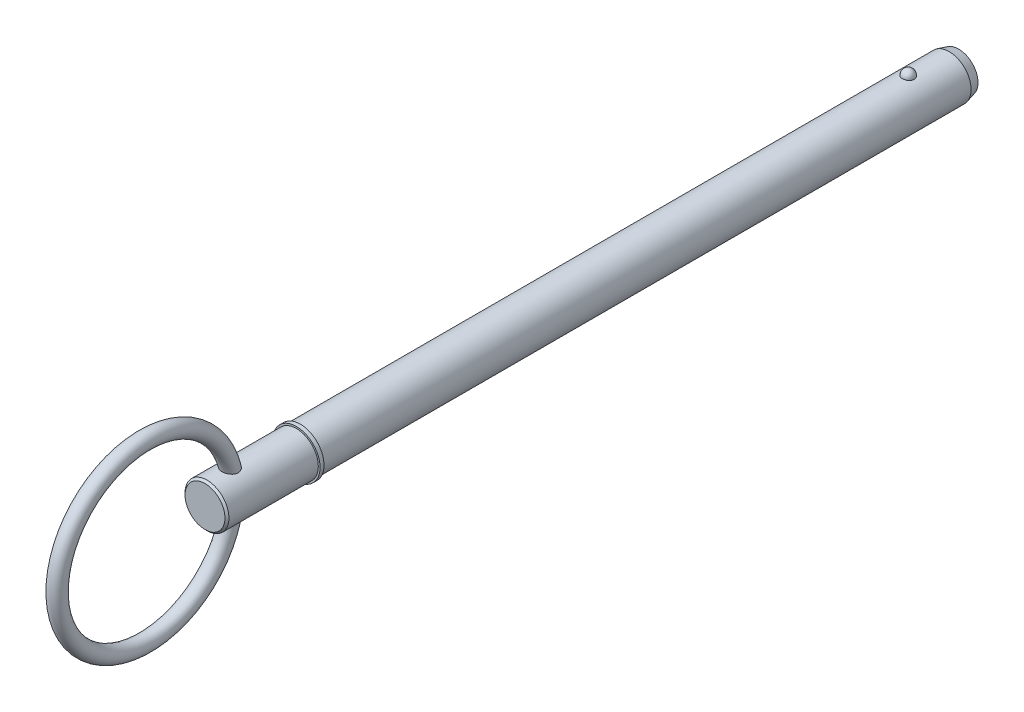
ISO-10303-21;
HEADER;
FILE_DESCRIPTION(('STEP AP214'),'2;1');
FILE_NAME('part.step','',(''),(''),'','','');
FILE_SCHEMA(('AUTOMOTIVE_DESIGN { 1 0 10303 214 1 1 1 1 }'));
ENDSEC;
DATA;
#1=APPLICATION_CONTEXT('core data for automotive mechanical design processes');
#2=APPLICATION_PROTOCOL_DEFINITION('international standard','automotive_design',2000,#1);
#3=PRODUCT_CONTEXT('',#1,'mechanical');
#4=PRODUCT('Part','Part','',(#3));
#5=PRODUCT_RELATED_PRODUCT_CATEGORY('part','',(#4));
#6=PRODUCT_DEFINITION_FORMATION('','',#4);
#7=PRODUCT_DEFINITION_CONTEXT('part definition',#1,'design');
#8=PRODUCT_DEFINITION('design','',#6,#7);
#9=PRODUCT_DEFINITION_SHAPE('','',#8);
#10=(LENGTH_UNIT() NAMED_UNIT(*) SI_UNIT(.MILLI.,.METRE.));
#11=(NAMED_UNIT(*) PLANE_ANGLE_UNIT() SI_UNIT($,.RADIAN.));
#12=(NAMED_UNIT(*) SI_UNIT($,.STERADIAN.) SOLID_ANGLE_UNIT());
#13=UNCERTAINTY_MEASURE_WITH_UNIT(LENGTH_MEASURE(1.E-05),#10,'distance_accuracy_value','');
#14=(GEOMETRIC_REPRESENTATION_CONTEXT(3) GLOBAL_UNCERTAINTY_ASSIGNED_CONTEXT((#13)) GLOBAL_UNIT_ASSIGNED_CONTEXT((#10,
#11,#12)) REPRESENTATION_CONTEXT('',''));
#15=CARTESIAN_POINT('',(0.,0.,0.));
#16=DIRECTION('',(0.,0.,1.));
#17=DIRECTION('',(1.,0.,0.));
#18=AXIS2_PLACEMENT_3D('',#15,#16,#17);
#19=CARTESIAN_POINT('',(0.,0.,152.4));
#20=DIRECTION('',(0.,0.,-1.));
#21=DIRECTION('',(-1.,0.,0.));
#22=AXIS2_PLACEMENT_3D('',#19,#20,#21);
#23=CYLINDRICAL_SURFACE('',#22,5.555);
#24=CARTESIAN_POINT('',(1.47653932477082,5.35517101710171,-1.49));
#25=CARTESIAN_POINT('',(1.4765376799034,5.35517235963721,-1.40667872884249));
#26=CARTESIAN_POINT('',(1.4697233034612,5.35706459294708,-1.32333626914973));
#27=CARTESIAN_POINT('',(1.4426291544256,5.36442332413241,-1.15900769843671));
#28=CARTESIAN_POINT('',(1.42234344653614,5.36989139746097,-1.07802264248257));
#29=CARTESIAN_POINT('',(1.36882802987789,5.38378061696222,-0.920757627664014));
#30=CARTESIAN_POINT('',(1.33560404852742,5.39220045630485,-0.844475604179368));
#31=CARTESIAN_POINT('',(1.25704906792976,5.41105136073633,-0.69870312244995));
#32=CARTESIAN_POINT('',(1.21171855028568,5.42148234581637,-0.62921239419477));
#33=CARTESIAN_POINT('',(1.10986325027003,5.44324765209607,-0.498626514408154));
#34=CARTESIAN_POINT('',(1.05328868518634,5.45458585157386,-0.437570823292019));
#35=CARTESIAN_POINT('',(0.930545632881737,5.4768596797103,-0.325918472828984));
#36=CARTESIAN_POINT('',(0.864377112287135,5.48779530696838,-0.275321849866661));
#37=CARTESIAN_POINT('',(0.724412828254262,5.50801510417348,-0.186125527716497));
#38=CARTESIAN_POINT('',(0.650637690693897,5.51730356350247,-0.147494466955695));
#39=CARTESIAN_POINT('',(0.497383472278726,5.53322345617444,-0.0831582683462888));
#40=CARTESIAN_POINT('',(0.417904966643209,5.53985515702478,-0.0574518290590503));
#41=CARTESIAN_POINT('',(0.256903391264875,5.54963245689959,-0.0200294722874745));
#42=CARTESIAN_POINT('',(0.175435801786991,5.55283384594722,-0.00808940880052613));
#43=CARTESIAN_POINT('',(0.0115885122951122,5.55559187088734,0.00221439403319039));
#44=CARTESIAN_POINT('',(-0.070791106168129,5.55514883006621,0.000579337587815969));
#45=CARTESIAN_POINT('',(-0.23298012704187,5.55069756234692,-0.0161051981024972));
#46=CARTESIAN_POINT('',(-0.312809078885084,5.54673626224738,-0.0309781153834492));
#47=CARTESIAN_POINT('',(-0.468771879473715,5.5357377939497,-0.073474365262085));
#48=CARTESIAN_POINT('',(-0.544905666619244,5.52870057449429,-0.101097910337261));
#49=CARTESIAN_POINT('',(-0.691800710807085,5.51225307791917,-0.168516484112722));
#50=CARTESIAN_POINT('',(-0.762530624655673,5.50283015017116,-0.208376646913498));
#51=CARTESIAN_POINT('',(-0.896294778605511,5.48263289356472,-0.29913698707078));
#52=CARTESIAN_POINT('',(-0.959328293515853,5.47185843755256,-0.350038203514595));
#53=CARTESIAN_POINT('',(-1.0771278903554,5.44990641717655,-0.462517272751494));
#54=CARTESIAN_POINT('',(-1.13172901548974,5.43872509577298,-0.524267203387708));
#55=CARTESIAN_POINT('',(-1.2299173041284,5.41736658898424,-0.656133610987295));
#56=CARTESIAN_POINT('',(-1.2735037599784,5.40718946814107,-0.726250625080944));
#57=CARTESIAN_POINT('',(-1.34896420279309,5.38886361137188,-0.873713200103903));
#58=CARTESIAN_POINT('',(-1.38071142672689,5.38073711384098,-0.951126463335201));
#59=CARTESIAN_POINT('',(-1.4310375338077,5.36757288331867,-1.11037033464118));
#60=CARTESIAN_POINT('',(-1.44961676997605,5.3625350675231,-1.19220082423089));
#61=CARTESIAN_POINT('',(-1.47308754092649,5.35613553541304,-1.35761209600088));
#62=CARTESIAN_POINT('',(-1.47803294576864,5.35475935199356,-1.44118467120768));
#63=CARTESIAN_POINT('',(-1.47426441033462,5.35579807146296,-1.6079958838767));
#64=CARTESIAN_POINT('',(-1.46555080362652,5.35821288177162,-1.69123452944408));
#65=CARTESIAN_POINT('',(-1.43475662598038,5.36653964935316,-1.8546288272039));
#66=CARTESIAN_POINT('',(-1.41273621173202,5.37243586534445,-1.93479663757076));
#67=CARTESIAN_POINT('',(-1.35593151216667,5.38705199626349,-2.09020110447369));
#68=CARTESIAN_POINT('',(-1.32114675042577,5.39577201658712,-2.16543757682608));
#69=CARTESIAN_POINT('',(-1.23947506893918,5.41511674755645,-2.30926926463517));
#70=CARTESIAN_POINT('',(-1.1925277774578,5.42575087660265,-2.37782893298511));
#71=CARTESIAN_POINT('',(-1.08780725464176,5.44771095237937,-2.50598876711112));
#72=CARTESIAN_POINT('',(-1.03003365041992,5.45903692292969,-2.56558862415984));
#73=CARTESIAN_POINT('',(-0.904953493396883,5.48116073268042,-2.67436535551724));
#74=CARTESIAN_POINT('',(-0.837616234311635,5.49195671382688,-2.7235073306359));
#75=CARTESIAN_POINT('',(-0.695379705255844,5.51177099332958,-2.80973172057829));
#76=CARTESIAN_POINT('',(-0.620480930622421,5.52078940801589,-2.84681492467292));
#77=CARTESIAN_POINT('',(-0.466144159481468,5.53594369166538,-2.90749751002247));
#78=CARTESIAN_POINT('',(-0.386768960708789,5.54211181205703,-2.93124844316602));
#79=CARTESIAN_POINT('',(-0.224991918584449,5.5510324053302,-2.96523308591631));
#80=CARTESIAN_POINT('',(-0.142590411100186,5.55378525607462,-2.97546829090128));
#81=CARTESIAN_POINT('',(0.0213711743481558,5.55555351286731,-2.98206550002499));
#82=CARTESIAN_POINT('',(0.102921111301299,5.55463281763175,-2.97866468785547));
#83=CARTESIAN_POINT('',(0.264256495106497,5.54929804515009,-2.95862186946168));
#84=CARTESIAN_POINT('',(0.344041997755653,5.54488407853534,-2.94198028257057));
#85=CARTESIAN_POINT('',(0.499344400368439,5.53305794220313,-2.89600357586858));
#86=CARTESIAN_POINT('',(0.574874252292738,5.52565550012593,-2.86670961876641));
#87=CARTESIAN_POINT('',(0.719898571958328,5.50863937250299,-2.79624249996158));
#88=CARTESIAN_POINT('',(0.789392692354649,5.49902555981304,-2.75506865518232));
#89=CARTESIAN_POINT('',(0.921480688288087,5.47845199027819,-2.66127110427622));
#90=CARTESIAN_POINT('',(0.983960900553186,5.46747485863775,-2.60849118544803));
#91=CARTESIAN_POINT('',(1.09925057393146,5.44546837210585,-2.49325304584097));
#92=CARTESIAN_POINT('',(1.15205830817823,5.43443900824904,-2.43079310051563));
#93=CARTESIAN_POINT('',(1.24742943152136,5.41335152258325,-2.29680711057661));
#94=CARTESIAN_POINT('',(1.28981661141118,5.40331162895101,-2.22515272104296));
#95=CARTESIAN_POINT('',(1.36214937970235,5.38553336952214,-2.07558035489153));
#96=CARTESIAN_POINT('',(1.39210034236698,5.37779400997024,-1.99766510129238));
#97=CARTESIAN_POINT('',(1.43569518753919,5.36630594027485,-1.84848338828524));
#98=CARTESIAN_POINT('',(1.45098536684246,5.36216169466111,-1.77772322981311));
#99=CARTESIAN_POINT('',(1.47140805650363,5.35659367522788,-1.63464735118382));
#100=CARTESIAN_POINT('',(1.47654075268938,5.35516985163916,-1.56233165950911));
#101=CARTESIAN_POINT('',(1.47653932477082,5.35517101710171,-1.49));
#102=B_SPLINE_CURVE_WITH_KNOTS('',3,(#24,#25,#26,#27,#28,#29,#30,#31,#32,#33,#34,#35,#36,#37,
#38,#39,#40,#41,#42,#43,#44,#45,#46,#47,#48,#49,#50,#51,#52,#53,#54,#55,#56,#57,#58,#59,#60,#61,
#62,#63,#64,#65,#66,#67,#68,#69,#70,#71,#72,#73,#74,#75,#76,#77,#78,#79,#80,#81,#82,#83,#84,#85,
#86,#87,#88,#89,#90,#91,#92,#93,#94,#95,#96,#97,#98,#99,#100,#101),.UNSPECIFIED.,.T.,.F.,(4,2,2,
2,2,2,2,2,2,2,2,2,2,2,2,2,2,2,2,2,2,2,2,2,2,2,2,2,2,2,2,2,2,2,2,2,2,2,4),(0.,0.249703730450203,
0.4995175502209,0.749220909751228,0.998914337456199,1.24973894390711,1.50056442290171,
1.75072681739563,2.00086401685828,2.24686822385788,2.49285060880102,2.73560052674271,
2.97835449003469,3.22242369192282,3.46651587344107,3.71490232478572,3.96330473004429,
4.21429522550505,4.46527899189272,4.71526963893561,4.96525418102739,5.21411697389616,
5.46298905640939,5.71312097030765,5.96326150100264,6.21422412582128,6.46517032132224,
6.71320296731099,6.96120816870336,7.20491846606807,7.44862104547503,7.69153667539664,
7.93446627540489,8.18089104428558,8.42735976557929,8.67774679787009,8.92802551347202,
9.14479867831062,9.36156787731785),.UNSPECIFIED.);
#103=CARTESIAN_POINT('',(1.47653932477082,5.35517101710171,-1.49));
#104=VERTEX_POINT('',#103);
#105=EDGE_CURVE('E103',#104,#104,#102,.T.);
#106=ORIENTED_EDGE('',*,*,#105,.T.);
#107=EDGE_LOOP('',(#106));
#108=FACE_BOUND('',#107,.T.);
#109=CARTESIAN_POINT('',(0.,0.,-11.8700000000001));
#110=DIRECTION('',(0.,0.,-1.));
#111=DIRECTION('',(-1.,0.,0.));
#112=AXIS2_PLACEMENT_3D('',#109,#110,#111);
#113=CIRCLE('',#112,5.555);
#114=CARTESIAN_POINT('',(-5.555,0.,-11.8700000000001));
#115=VERTEX_POINT('',#114);
#116=EDGE_CURVE('E110',#115,#115,#113,.F.);
#117=ORIENTED_EDGE('',*,*,#116,.T.);
#118=EDGE_LOOP('',(#117));
#119=FACE_BOUND('',#118,.T.);
#120=CARTESIAN_POINT('',(0.,0.,152.4));
#121=DIRECTION('',(0.,0.,1.));
#122=DIRECTION('',(1.,0.,0.));
#123=AXIS2_PLACEMENT_3D('',#120,#121,#122);
#124=CIRCLE('',#123,5.555);
#125=CARTESIAN_POINT('',(5.555,0.,152.4));
#126=VERTEX_POINT('',#125);
#127=EDGE_CURVE('E108',#126,#126,#124,.T.);
#128=ORIENTED_EDGE('',*,*,#127,.F.);
#129=EDGE_LOOP('',(#128));
#130=FACE_BOUND('',#129,.T.);
#131=ADVANCED_FACE('F39',(#108,#119,#130),#23,.T.);
#132=CARTESIAN_POINT('',(0.,0.,-14.27));
#133=DIRECTION('',(0.,0.,-1.));
#134=DIRECTION('',(-1.,0.,0.));
#135=AXIS2_PLACEMENT_3D('',#132,#133,#134);
#136=PLANE('',#135);
#137=CARTESIAN_POINT('',(0.,0.,-14.27));
#138=DIRECTION('',(0.,0.,-1.));
#139=DIRECTION('',(-1.,0.,0.));
#140=AXIS2_PLACEMENT_3D('',#137,#138,#139);
#141=CIRCLE('',#140,4.91192193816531);
#142=CARTESIAN_POINT('',(-4.91192193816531,0.,-14.27));
#143=VERTEX_POINT('',#142);
#144=EDGE_CURVE('E141',#143,#143,#141,.T.);
#145=ORIENTED_EDGE('',*,*,#144,.T.);
#146=EDGE_LOOP('',(#145));
#147=FACE_BOUND('',#146,.T.);
#148=ADVANCED_FACE('F89',(#147),#136,.T.);
#149=CARTESIAN_POINT('',(0.,0.,-14.27));
#150=DIRECTION('',(0.,0.,1.));
#151=DIRECTION('',(1.,0.,0.));
#152=AXIS2_PLACEMENT_3D('',#149,#150,#151);
#153=CONICAL_SURFACE('',#152,4.91192193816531,0.261799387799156);
#154=ORIENTED_EDGE('',*,*,#116,.F.);
#155=EDGE_LOOP('',(#154));
#156=FACE_BOUND('',#155,.T.);
#157=ORIENTED_EDGE('',*,*,#144,.F.);
#158=EDGE_LOOP('',(#157));
#159=FACE_BOUND('',#158,.T.);
#160=ADVANCED_FACE('F95',(#156,#159),#153,.T.);
#161=CARTESIAN_POINT('',(0.,5.555,-1.49));
#162=DIRECTION('',(0.,1.,0.));
#163=DIRECTION('',(0.,0.,1.));
#164=AXIS2_PLACEMENT_3D('',#161,#162,#163);
#165=SPHERICAL_SURFACE('',#164,1.49);
#166=ORIENTED_EDGE('',*,*,#105,.F.);
#167=EDGE_LOOP('',(#166));
#168=FACE_BOUND('',#167,.T.);
#169=ADVANCED_FACE('F113',(#168),#165,.T.);
#170=CARTESIAN_POINT('',(0.,0.,152.4));
#171=DIRECTION('',(0.,0.,-1.));
#172=DIRECTION('',(-1.,0.,0.));
#173=AXIS2_PLACEMENT_3D('',#170,#171,#172);
#174=PLANE('',#173);
#175=ORIENTED_EDGE('',*,*,#127,.T.);
#176=EDGE_LOOP('',(#175));
#177=FACE_BOUND('',#176,.T.);
#178=CARTESIAN_POINT('',(0.,0.,152.4));
#179=DIRECTION('',(0.,0.,-1.));
#180=DIRECTION('',(-1.,0.,0.));
#181=AXIS2_PLACEMENT_3D('',#178,#179,#180);
#182=CIRCLE('',#181,6.);
#183=CARTESIAN_POINT('',(-6.,0.,152.4));
#184=VERTEX_POINT('',#183);
#185=EDGE_CURVE('E109',#184,#184,#182,.T.);
#186=ORIENTED_EDGE('',*,*,#185,.T.);
#187=EDGE_LOOP('',(#186));
#188=FACE_BOUND('',#187,.T.);
#189=ADVANCED_FACE('F117',(#177,#188),#174,.T.);
#190=CARTESIAN_POINT('',(0.,0.,33.7287874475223));
#191=DIRECTION('',(0.,0.,-1.));
#192=DIRECTION('',(-1.,0.,0.));
#193=AXIS2_PLACEMENT_3D('',#190,#191,#192);
#194=CYLINDRICAL_SURFACE('',#193,6.);
#195=CARTESIAN_POINT('',(0.,0.,153.4));
#196=DIRECTION('',(0.,0.,-1.));
#197=DIRECTION('',(-1.,0.,0.));
#198=AXIS2_PLACEMENT_3D('',#195,#196,#197);
#199=CIRCLE('',#198,6.);
#200=CARTESIAN_POINT('',(-6.,0.,153.4));
#201=VERTEX_POINT('',#200);
#202=EDGE_CURVE('E134',#201,#201,#199,.T.);
#203=ORIENTED_EDGE('',*,*,#202,.T.);
#204=EDGE_LOOP('',(#203));
#205=FACE_BOUND('',#204,.T.);
#206=ORIENTED_EDGE('',*,*,#185,.F.);
#207=EDGE_LOOP('',(#206));
#208=FACE_BOUND('',#207,.T.);
#209=ADVANCED_FACE('F121',(#205,#208),#194,.T.);
#210=CARTESIAN_POINT('',(0.,6.,153.4));
#211=DIRECTION('',(0.,0.,1.));
#212=DIRECTION('',(1.,0.,0.));
#213=AXIS2_PLACEMENT_3D('',#210,#211,#212);
#214=PLANE('',#213);
#215=CARTESIAN_POINT('',(0.,0.,153.4));
#216=DIRECTION('',(0.,0.,1.));
#217=DIRECTION('',(1.,0.,0.));
#218=AXIS2_PLACEMENT_3D('',#215,#216,#217);
#219=CIRCLE('',#218,5.555);
#220=CARTESIAN_POINT('',(5.555,0.,153.4));
#221=VERTEX_POINT('',#220);
#222=EDGE_CURVE('E112',#221,#221,#219,.T.);
#223=ORIENTED_EDGE('',*,*,#222,.F.);
#224=EDGE_LOOP('',(#223));
#225=FACE_BOUND('',#224,.T.);
#226=ORIENTED_EDGE('',*,*,#202,.F.);
#227=EDGE_LOOP('',(#226));
#228=FACE_BOUND('',#227,.T.);
#229=ADVANCED_FACE('F86',(#225,#228),#214,.T.);
#230=CARTESIAN_POINT('',(0.,0.,176.53));
#231=DIRECTION('',(0.,0.,-1.));
#232=DIRECTION('',(-1.,0.,0.));
#233=AXIS2_PLACEMENT_3D('',#230,#231,#232);
#234=CYLINDRICAL_SURFACE('',#233,5.555);
#235=CARTESIAN_POINT('',(-0.961380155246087,-5.47117658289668,168.408733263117));
#236=CARTESIAN_POINT('',(-0.863231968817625,-5.4884217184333,168.357515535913));
#237=CARTESIAN_POINT('',(-0.760548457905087,-5.50372118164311,168.314318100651));
#238=CARTESIAN_POINT('',(-0.548956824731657,-5.52883500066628,168.244912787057));
#239=CARTESIAN_POINT('',(-0.440048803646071,-5.53864944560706,168.218704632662));
#240=CARTESIAN_POINT('',(-0.219033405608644,-5.55178384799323,168.183864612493));
#241=CARTESIAN_POINT('',(-0.106925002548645,-5.55510169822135,168.175238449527));
#242=CARTESIAN_POINT('',(0.11723899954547,-5.55489351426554,168.175783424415));
#243=CARTESIAN_POINT('',(0.229294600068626,-5.55136768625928,168.184954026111));
#244=CARTESIAN_POINT('',(0.449588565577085,-5.5378711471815,168.220784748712));
#245=CARTESIAN_POINT('',(0.557843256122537,-5.52793284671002,168.247356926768));
#246=CARTESIAN_POINT('',(0.768116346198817,-5.50265785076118,168.317309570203));
#247=CARTESIAN_POINT('',(0.870134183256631,-5.48732066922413,168.360691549));
#248=CARTESIAN_POINT('',(1.06580880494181,-5.45270790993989,168.463685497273));
#249=CARTESIAN_POINT('',(1.1594033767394,-5.43340601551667,168.523406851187));
#250=CARTESIAN_POINT('',(1.33484934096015,-5.39298781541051,168.657672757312));
#251=CARTESIAN_POINT('',(1.41670019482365,-5.37187142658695,168.732217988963));
#252=CARTESIAN_POINT('',(1.56628651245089,-5.33017932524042,168.894433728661));
#253=CARTESIAN_POINT('',(1.63402728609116,-5.30960341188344,168.982099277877));
#254=CARTESIAN_POINT('',(1.75338323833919,-5.27139606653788,169.16835593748));
#255=CARTESIAN_POINT('',(1.80500413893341,-5.25376359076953,169.266943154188));
#256=CARTESIAN_POINT('',(1.88923054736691,-5.22405733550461,169.468866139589));
#257=CARTESIAN_POINT('',(1.92240068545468,-5.21182119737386,169.571942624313));
#258=CARTESIAN_POINT('',(1.97156802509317,-5.19342304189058,169.782612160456));
#259=CARTESIAN_POINT('',(1.98756752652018,-5.18726021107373,169.890204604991));
#260=CARTESIAN_POINT('',(2.00238957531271,-5.1815556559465,170.104813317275));
#261=CARTESIAN_POINT('',(2.0015062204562,-5.18190056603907,170.211807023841));
#262=CARTESIAN_POINT('',(1.98404322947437,-5.18861029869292,170.424294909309));
#263=CARTESIAN_POINT('',(1.96745884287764,-5.19497694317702,170.52978862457));
#264=CARTESIAN_POINT('',(1.91810947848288,-5.21340722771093,170.743734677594));
#265=CARTESIAN_POINT('',(1.88435438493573,-5.22581720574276,170.851927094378));
#266=CARTESIAN_POINT('',(1.80161540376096,-5.25491400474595,171.061718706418));
#267=CARTESIAN_POINT('',(1.7526231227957,-5.27160318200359,171.163314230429));
#268=CARTESIAN_POINT('',(1.63431251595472,-5.30955034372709,171.368856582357));
#269=CARTESIAN_POINT('',(1.5633341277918,-5.33111051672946,171.47179646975));
#270=CARTESIAN_POINT('',(1.4052960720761,-5.37493145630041,171.66447165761));
#271=CARTESIAN_POINT('',(1.31822569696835,-5.39719268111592,171.754198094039));
#272=CARTESIAN_POINT('',(1.12728892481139,-5.44031451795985,171.919004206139));
#273=CARTESIAN_POINT('',(1.02309899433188,-5.46113424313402,171.993723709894));
#274=CARTESIAN_POINT('',(0.801576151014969,-5.49800171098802,172.121805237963));
#275=CARTESIAN_POINT('',(0.684264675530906,-5.51405708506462,172.175201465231));
#276=CARTESIAN_POINT('',(0.45687763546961,-5.53719478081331,172.250980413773));
#277=CARTESIAN_POINT('',(0.34797457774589,-5.54519800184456,172.276584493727));
#278=CARTESIAN_POINT('',(0.127042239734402,-5.55464249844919,172.306731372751));
#279=CARTESIAN_POINT('',(0.0150164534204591,-5.55609083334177,172.311296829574));
#280=CARTESIAN_POINT('',(-0.19199318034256,-5.55250986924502,172.299911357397));
#281=CARTESIAN_POINT('',(-0.287160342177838,-5.54836194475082,172.286752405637));
#282=CARTESIAN_POINT('',(-0.473863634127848,-5.53554271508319,172.245489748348));
#283=CARTESIAN_POINT('',(-0.565399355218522,-5.52687090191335,172.217384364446));
#284=CARTESIAN_POINT('',(-0.743786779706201,-5.50572322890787,172.147293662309));
#285=CARTESIAN_POINT('',(-0.830566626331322,-5.49320168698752,172.105141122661));
#286=CARTESIAN_POINT('',(-0.996720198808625,-5.46549909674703,172.008875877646));
#287=CARTESIAN_POINT('',(-1.07609119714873,-5.45031707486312,171.954758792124));
#288=CARTESIAN_POINT('',(-1.23672272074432,-5.41628785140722,171.828211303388));
#289=CARTESIAN_POINT('',(-1.3167603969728,-5.39722327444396,171.75428911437));
#290=CARTESIAN_POINT('',(-1.46504263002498,-5.3588760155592,171.595462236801));
#291=CARTESIAN_POINT('',(-1.5332782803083,-5.33959318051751,171.510549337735));
#292=CARTESIAN_POINT('',(-1.66602271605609,-5.29979878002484,171.318697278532));
#293=CARTESIAN_POINT('',(-1.72857256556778,-5.27951148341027,171.210347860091));
#294=CARTESIAN_POINT('',(-1.83559571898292,-5.24326402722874,170.984325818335));
#295=CARTESIAN_POINT('',(-1.88006296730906,-5.22730531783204,170.866650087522));
#296=CARTESIAN_POINT('',(-1.94988009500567,-5.20167534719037,170.622087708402));
#297=CARTESIAN_POINT('',(-1.97477410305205,-5.19215470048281,170.49505279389));
#298=CARTESIAN_POINT('',(-2.00168294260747,-5.18184594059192,170.238249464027));
#299=CARTESIAN_POINT('',(-2.00372217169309,-5.18104851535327,170.10848411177));
#300=CARTESIAN_POINT('',(-1.98467753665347,-5.18836681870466,169.864652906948));
#301=CARTESIAN_POINT('',(-1.96600067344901,-5.19555485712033,169.750370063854));
#302=CARTESIAN_POINT('',(-1.90923541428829,-5.21668050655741,169.527389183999));
#303=CARTESIAN_POINT('',(-1.87115335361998,-5.23061591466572,169.418689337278));
#304=CARTESIAN_POINT('',(-1.78015350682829,-5.26224244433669,169.218371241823));
#305=CARTESIAN_POINT('',(-1.72857344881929,-5.27957041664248,169.12608293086));
#306=CARTESIAN_POINT('',(-1.61106729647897,-5.31660340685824,168.951684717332));
#307=CARTESIAN_POINT('',(-1.54514024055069,-5.33630858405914,168.869575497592));
#308=CARTESIAN_POINT('',(-1.39929408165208,-5.37641320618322,168.715887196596));
#309=CARTESIAN_POINT('',(-1.31912544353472,-5.39681868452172,168.644546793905));
#310=CARTESIAN_POINT('',(-1.14786008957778,-5.43582099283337,168.515855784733));
#311=CARTESIAN_POINT('',(-1.05676174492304,-5.4544175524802,168.458507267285));
#312=CARTESIAN_POINT('',(-0.961380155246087,-5.47117658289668,168.408733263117));
#313=B_SPLINE_CURVE_WITH_KNOTS('',3,(#235,#236,#237,#238,#239,#240,#241,#242,#243,#244,#245,
#246,#247,#248,#249,#250,#251,#252,#253,#254,#255,#256,#257,#258,#259,#260,#261,#262,#263,#264,
#265,#266,#267,#268,#269,#270,#271,#272,#273,#274,#275,#276,#277,#278,#279,#280,#281,#282,#283,
#284,#285,#286,#287,#288,#289,#290,#291,#292,#293,#294,#295,#296,#297,#298,#299,#300,#301,#302,
#303,#304,#305,#306,#307,#308,#309,#310,#311,#312),.UNSPECIFIED.,.T.,.F.,(4,2,2,2,2,2,2,2,2,2,2,
2,2,2,2,2,2,2,2,2,2,2,2,2,2,2,2,2,2,2,2,2,2,2,2,2,2,2,4),(0.,0.335747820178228,
0.671490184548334,1.00734143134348,1.34318256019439,1.67733940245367,2.01152633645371,
2.34800767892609,2.6845044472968,3.02087435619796,3.35712472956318,3.68242216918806,
4.00767603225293,4.32726924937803,4.6469591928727,4.98762165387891,5.32847210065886,
5.7074287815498,6.08663853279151,6.47407889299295,6.86089527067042,7.19531213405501,
7.52936875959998,7.81649827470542,8.10366003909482,8.39437023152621,8.68518702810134,
9.01572837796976,9.34651809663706,9.72504519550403,10.1036989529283,10.4909301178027,
10.8777478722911,11.2239231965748,11.5699855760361,11.8899109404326,12.2098577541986,
12.5360928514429,12.8623766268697),.UNSPECIFIED.);
#314=CARTESIAN_POINT('',(-0.961380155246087,-5.47117658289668,168.408733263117));
#315=VERTEX_POINT('',#314);
#316=EDGE_CURVE('E10',#315,#315,#313,.T.);
#317=ORIENTED_EDGE('',*,*,#316,.F.);
#318=EDGE_LOOP('',(#317));
#319=FACE_BOUND('',#318,.T.);
#320=CARTESIAN_POINT('',(-0.961380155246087,5.47117658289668,168.408733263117));
#321=CARTESIAN_POINT('',(-1.05891474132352,5.45403910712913,168.459631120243));
#322=CARTESIAN_POINT('',(-1.15197270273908,5.43497920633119,168.518451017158));
#323=CARTESIAN_POINT('',(-1.32661268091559,5.39501222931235,168.65070162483));
#324=CARTESIAN_POINT('',(-1.40819495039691,5.37410519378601,168.724132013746));
#325=CARTESIAN_POINT('',(-1.55769110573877,5.33269731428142,168.884098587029));
#326=CARTESIAN_POINT('',(-1.62558729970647,5.31219702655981,168.970651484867));
#327=CARTESIAN_POINT('',(-1.74556031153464,5.2739951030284,169.154646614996));
#328=CARTESIAN_POINT('',(-1.7976419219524,5.25629262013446,169.252085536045));
#329=CARTESIAN_POINT('',(-1.88339939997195,5.22617061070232,169.452565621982));
#330=CARTESIAN_POINT('',(-1.91750373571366,5.21362983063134,169.555405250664));
#331=CARTESIAN_POINT('',(-1.96852412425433,5.194582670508,169.765778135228));
#332=CARTESIAN_POINT('',(-1.98544249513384,5.18807547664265,169.873310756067));
#333=CARTESIAN_POINT('',(-2.00201964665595,5.18170011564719,170.087819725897));
#334=CARTESIAN_POINT('',(-2.00199605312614,5.18170977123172,170.194768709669));
#335=CARTESIAN_POINT('',(-1.98621575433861,5.18777751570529,170.407306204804));
#336=CARTESIAN_POINT('',(-1.97045441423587,5.19383738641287,170.512894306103));
#337=CARTESIAN_POINT('',(-1.92280904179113,5.21167084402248,170.726914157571));
#338=CARTESIAN_POINT('',(-1.88996782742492,5.22378174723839,170.835103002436));
#339=CARTESIAN_POINT('',(-1.80906901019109,5.25234475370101,171.045029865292));
#340=CARTESIAN_POINT('',(-1.76100319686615,5.26879919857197,171.146764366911));
#341=CARTESIAN_POINT('',(-1.64464870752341,5.30634509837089,171.352788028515));
#342=CARTESIAN_POINT('',(-1.57469702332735,5.32774959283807,171.456085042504));
#343=CARTESIAN_POINT('',(-1.41872356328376,5.37138743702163,171.649688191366));
#344=CARTESIAN_POINT('',(-1.33269066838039,5.39362135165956,171.739985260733));
#345=CARTESIAN_POINT('',(-1.14345202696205,5.43692909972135,171.906557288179));
#346=CARTESIAN_POINT('',(-1.03986000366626,5.45795811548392,171.982409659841));
#347=CARTESIAN_POINT('',(-0.819338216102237,5.49537389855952,172.112916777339));
#348=CARTESIAN_POINT('',(-0.702429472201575,5.51176784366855,172.167604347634));
#349=CARTESIAN_POINT('',(-0.475167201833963,5.53565843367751,172.24602203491));
#350=CARTESIAN_POINT('',(-0.365997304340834,5.5440461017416,172.272893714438));
#351=CARTESIAN_POINT('',(-0.144272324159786,5.55422966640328,172.305426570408));
#352=CARTESIAN_POINT('',(-0.0317212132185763,5.55603301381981,172.311111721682));
#353=CARTESIAN_POINT('',(0.176166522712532,5.55303883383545,172.301592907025));
#354=CARTESIAN_POINT('',(0.271662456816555,5.54914868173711,172.289260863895));
#355=CARTESIAN_POINT('',(0.45914083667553,5.53678955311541,172.249523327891));
#356=CARTESIAN_POINT('',(0.5511229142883,5.52832009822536,172.222116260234));
#357=CARTESIAN_POINT('',(0.730082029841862,5.50755841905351,172.153437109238));
#358=CARTESIAN_POINT('',(0.817013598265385,5.49523641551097,172.112056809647));
#359=CARTESIAN_POINT('',(0.98356924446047,5.46788364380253,172.017293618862));
#360=CARTESIAN_POINT('',(1.06319070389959,5.45285191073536,171.963906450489));
#361=CARTESIAN_POINT('',(1.22430017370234,5.4191117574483,171.838982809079));
#362=CARTESIAN_POINT('',(1.30459540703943,5.40018081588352,171.765970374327));
#363=CARTESIAN_POINT('',(1.45353150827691,5.3620139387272,171.608943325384));
#364=CARTESIAN_POINT('',(1.52216366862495,5.3427777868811,171.524920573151));
#365=CARTESIAN_POINT('',(1.65601602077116,5.30294271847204,171.334811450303));
#366=CARTESIAN_POINT('',(1.71927851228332,5.28255425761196,171.227294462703));
#367=CARTESIAN_POINT('',(1.82790996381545,5.24595721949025,171.002847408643));
#368=CARTESIAN_POINT('',(1.8732722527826,5.22975020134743,170.885913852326));
#369=CARTESIAN_POINT('',(1.94526503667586,5.20341207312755,170.642194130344));
#370=CARTESIAN_POINT('',(1.97135787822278,5.1934564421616,170.51522738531));
#371=CARTESIAN_POINT('',(2.00068973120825,5.18223330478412,170.258318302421));
#372=CARTESIAN_POINT('',(2.00395290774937,5.18095661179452,170.128379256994));
#373=CARTESIAN_POINT('',(1.98717985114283,5.1874070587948,169.883763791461));
#374=CARTESIAN_POINT('',(1.96951989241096,5.19421607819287,169.768899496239));
#375=CARTESIAN_POINT('',(1.91463360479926,5.2146960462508,169.544589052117));
#376=CARTESIAN_POINT('',(1.87741409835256,5.22836460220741,169.435141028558));
#377=CARTESIAN_POINT('',(1.78800305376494,5.25957304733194,169.233542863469));
#378=CARTESIAN_POINT('',(1.73720600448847,5.27672774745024,169.140709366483));
#379=CARTESIAN_POINT('',(1.62116201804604,5.3135255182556,168.965121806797));
#380=CARTESIAN_POINT('',(1.55591428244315,5.33316872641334,168.882368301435));
#381=CARTESIAN_POINT('',(1.41164041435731,5.37317145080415,168.727648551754));
#382=CARTESIAN_POINT('',(1.3324195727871,5.39353732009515,168.655865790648));
#383=CARTESIAN_POINT('',(1.16300716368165,5.43258596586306,168.526112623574));
#384=CARTESIAN_POINT('',(1.07281393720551,5.45126848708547,168.468144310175));
#385=CARTESIAN_POINT('',(0.880638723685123,5.48564753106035,168.365507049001));
#386=CARTESIAN_POINT('',(0.778364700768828,5.50122427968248,168.321343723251));
#387=CARTESIAN_POINT('',(0.567418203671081,5.52696543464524,168.249973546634));
#388=CARTESIAN_POINT('',(0.458745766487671,5.53712987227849,168.22276659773));
#389=CARTESIAN_POINT('',(0.237791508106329,5.55101406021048,168.185879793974));
#390=CARTESIAN_POINT('',(0.125501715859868,5.55471842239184,168.17624178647));
#391=CARTESIAN_POINT('',(-0.0992056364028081,5.55525045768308,168.174849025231));
#392=CARTESIAN_POINT('',(-0.211623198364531,5.55207802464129,168.183094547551));
#393=CARTESIAN_POINT('',(-0.434217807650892,5.53913427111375,168.217408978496));
#394=CARTESIAN_POINT('',(-0.544370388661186,5.5293114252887,168.243617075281));
#395=CARTESIAN_POINT('',(-0.758352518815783,5.50404767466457,168.313395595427));
#396=CARTESIAN_POINT('',(-0.862181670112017,5.48860641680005,168.356967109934));
#397=CARTESIAN_POINT('',(-0.961380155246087,5.47117658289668,168.408733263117));
#398=B_SPLINE_CURVE_WITH_KNOTS('',3,(#320,#321,#322,#323,#324,#325,#326,#327,#328,#329,#330,
#331,#332,#333,#334,#335,#336,#337,#338,#339,#340,#341,#342,#343,#344,#345,#346,#347,#348,#349,
#350,#351,#352,#353,#354,#355,#356,#357,#358,#359,#360,#361,#362,#363,#364,#365,#366,#367,#368,
#369,#370,#371,#372,#373,#374,#375,#376,#377,#378,#379,#380,#381,#382,#383,#384,#385,#386,#387,
#388,#389,#390,#391,#392,#393,#394,#395,#396,#397),.UNSPECIFIED.,.T.,.F.,(4,2,2,2,2,2,2,2,2,2,2,
2,2,2,2,2,2,2,2,2,2,2,2,2,2,2,2,2,2,2,2,2,2,2,2,2,2,2,4),(0.,0.33363642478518,0.667265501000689,
1.0013231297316,1.3352794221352,1.6608682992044,1.98641325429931,2.30585509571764,
2.62539104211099,2.96514840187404,3.3050893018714,3.68313901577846,4.06145109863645,
4.44953802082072,4.83702062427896,5.17316628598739,5.50893144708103,5.79666415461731,
6.08442692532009,6.37447144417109,6.66461944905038,6.99384361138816,7.32331250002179,
7.70083591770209,8.07849989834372,8.46633986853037,8.85376924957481,9.20110411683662,
9.54831791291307,9.86844524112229,10.1885902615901,10.5136110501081,10.8386810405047,
11.1745469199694,11.5104108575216,11.847073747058,12.183741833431,12.5230486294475,
12.8623767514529),.UNSPECIFIED.);
#399=CARTESIAN_POINT('',(-0.961380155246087,5.47117658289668,168.408733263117));
#400=VERTEX_POINT('',#399);
#401=EDGE_CURVE('E51',#400,#400,#398,.T.);
#402=ORIENTED_EDGE('',*,*,#401,.F.);
#403=EDGE_LOOP('',(#402));
#404=FACE_BOUND('',#403,.T.);
#405=CARTESIAN_POINT('',(0.,0.,176.03));
#406=DIRECTION('',(0.,0.,-1.));
#407=DIRECTION('',(-1.,0.,0.));
#408=AXIS2_PLACEMENT_3D('',#405,#406,#407);
#409=CIRCLE('',#408,5.555);
#410=CARTESIAN_POINT('',(-5.555,0.,176.03));
#411=VERTEX_POINT('',#410);
#412=EDGE_CURVE('E65',#411,#411,#409,.T.);
#413=ORIENTED_EDGE('',*,*,#412,.T.);
#414=EDGE_LOOP('',(#413));
#415=FACE_BOUND('',#414,.T.);
#416=ORIENTED_EDGE('',*,*,#222,.T.);
#417=EDGE_LOOP('',(#416));
#418=FACE_BOUND('',#417,.T.);
#419=ADVANCED_FACE('F70',(#319,#404,#415,#418),#234,.T.);
#420=CARTESIAN_POINT('',(0.,0.,176.53));
#421=DIRECTION('',(0.,0.,-1.));
#422=DIRECTION('',(-1.,0.,0.));
#423=AXIS2_PLACEMENT_3D('',#420,#421,#422);
#424=PLANE('',#423);
#425=CARTESIAN_POINT('',(0.,0.,176.53));
#426=DIRECTION('',(0.,0.,-1.));
#427=DIRECTION('',(-1.,0.,0.));
#428=AXIS2_PLACEMENT_3D('',#425,#426,#427);
#429=CIRCLE('',#428,5.05499999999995);
#430=CARTESIAN_POINT('',(-5.05499999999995,0.,176.53));
#431=VERTEX_POINT('',#430);
#432=EDGE_CURVE('E58',#431,#431,#429,.F.);
#433=ORIENTED_EDGE('',*,*,#432,.T.);
#434=EDGE_LOOP('',(#433));
#435=FACE_BOUND('',#434,.T.);
#436=ADVANCED_FACE('F77',(#435),#424,.F.);
#437=CARTESIAN_POINT('',(0.,0.,176.03));
#438=DIRECTION('',(0.,0.,-1.));
#439=DIRECTION('',(-1.,0.,0.));
#440=AXIS2_PLACEMENT_3D('',#437,#438,#439);
#441=CONICAL_SURFACE('',#440,5.555,0.785398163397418);
#442=ORIENTED_EDGE('',*,*,#432,.F.);
#443=EDGE_LOOP('',(#442));
#444=FACE_BOUND('',#443,.T.);
#445=ORIENTED_EDGE('',*,*,#412,.F.);
#446=EDGE_LOOP('',(#445));
#447=FACE_BOUND('',#446,.T.);
#448=ADVANCED_FACE('F41',(#444,#447),#441,.T.);
#449=CARTESIAN_POINT('',(0.,0.,191.755));
#450=DIRECTION('',(1.,0.,0.));
#451=DIRECTION('',(0.,0.,-1.));
#452=AXIS2_PLACEMENT_3D('',#449,#450,#451);
#453=TOROIDAL_SURFACE('',#452,22.225,2.);
#454=ORIENTED_EDGE('',*,*,#316,.T.);
#455=EDGE_LOOP('',(#454));
#456=FACE_BOUND('',#455,.T.);
#457=ORIENTED_EDGE('',*,*,#401,.T.);
#458=EDGE_LOOP('',(#457));
#459=FACE_BOUND('',#458,.T.);
#460=ADVANCED_FACE('F74',(#456,#459),#453,.T.);
#461=CLOSED_SHELL('',(#131,#148,#160,#169,#189,#209,#229,#419,#436,#448,#460));
#462=MANIFOLD_SOLID_BREP('B2',#461);
#463=ADVANCED_BREP_SHAPE_REPRESENTATION('',(#18,#462),#14);
#464=SHAPE_DEFINITION_REPRESENTATION(#9,#463);
ENDSEC;
END-ISO-10303-21;
